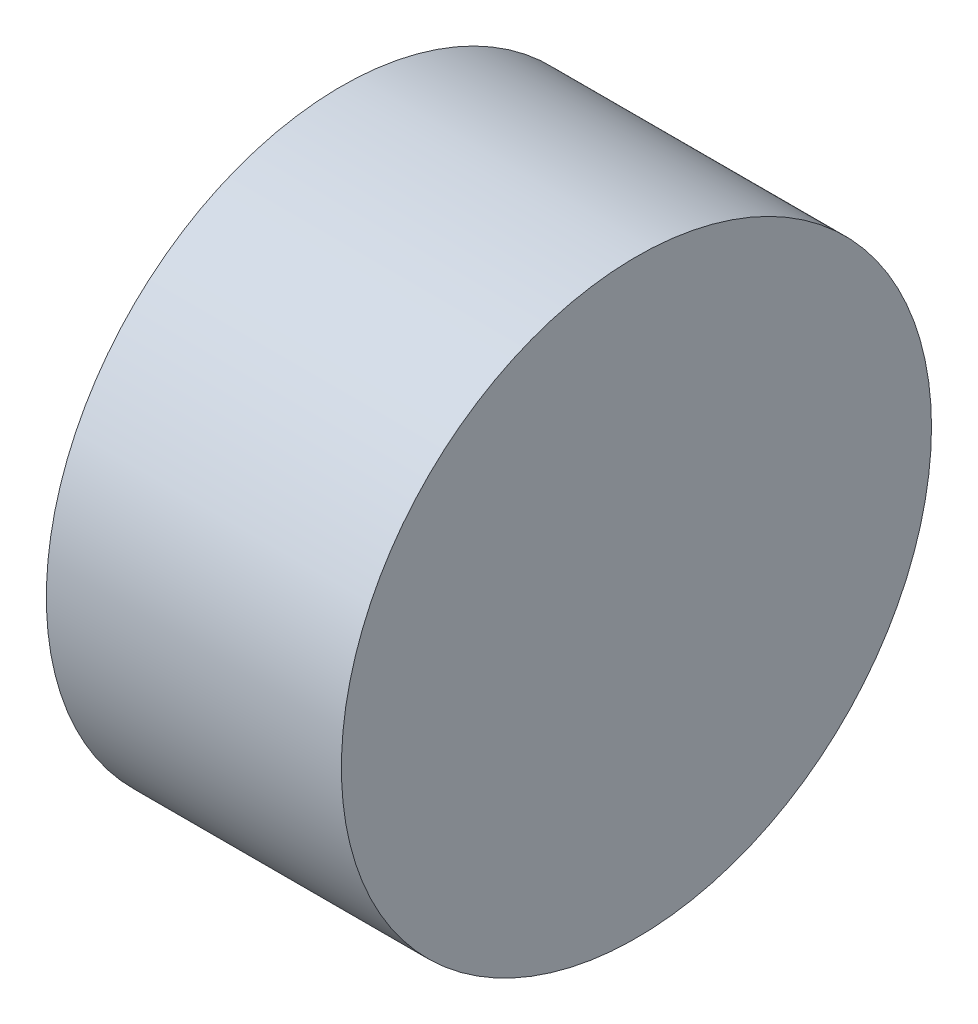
from build123d import *

# Parameters (mm, degrees)
SKETCH1_R           = 30
SKETCH1_R_2         = 2.5
BOSS_EXTRUDE1_DEPTH = 10
SKETCH2_R           = 30
BOSS_EXTRUDE2_DEPTH = 20


with BuildPart() as part:
    # Sketch1 → Boss-Extrude1 (new body)
    with BuildSketch(Plane(origin=(0, 0, 0), x_dir=(0, 0, -1), z_dir=(1, 0, 0))):
        Circle(SKETCH1_R)
        Circle(SKETCH1_R_2, mode=Mode.SUBTRACT)
    extrude(amount=BOSS_EXTRUDE1_DEPTH)

    # Sketch2 → Boss-Extrude2 (add)
    with BuildSketch(Plane(origin=(10, 0, 0), x_dir=(0, 0, -1), z_dir=(1, 0, 0))):
        Circle(SKETCH2_R)
    extrude(amount=BOSS_EXTRUDE2_DEPTH)


solid = part.part
